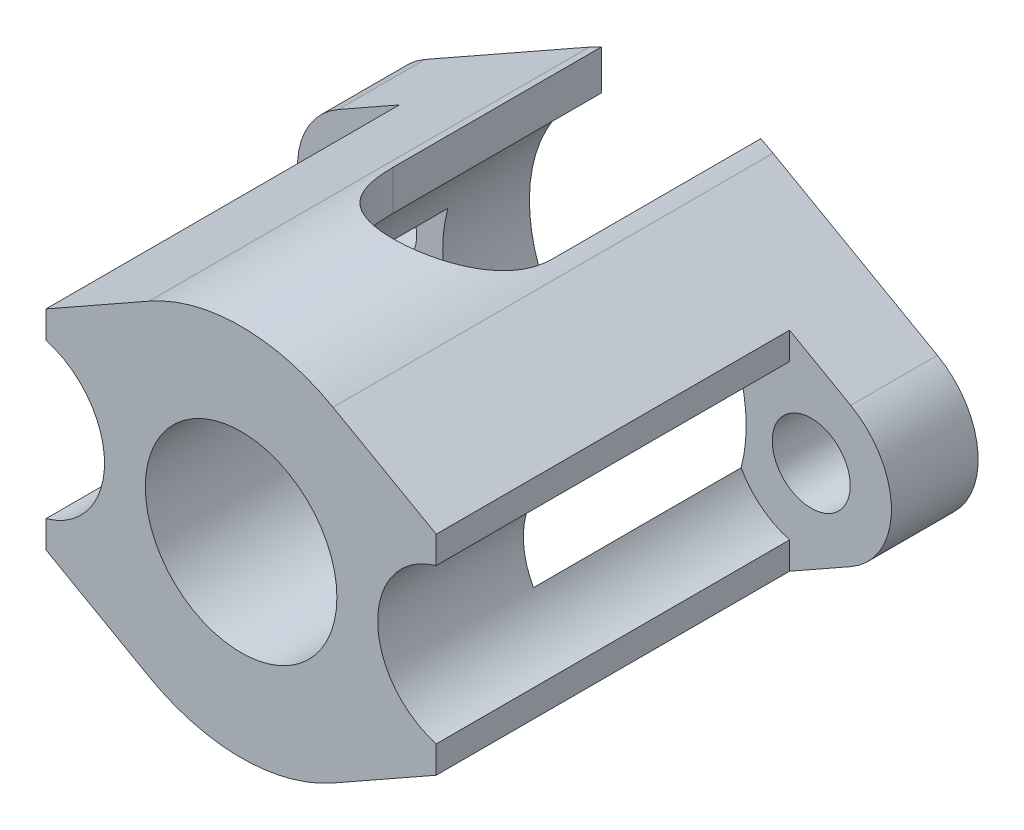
from build123d import *

# Parameters (mm, degrees)
SKETCH1_R               = 2.286
SKETCH1_R_2             = 5.6134
BOSS_EXTRUDE1_DEPTH     = 25.781
SKETCH2_R               = 8.89
CUT_EXTRUDE1_DEPTH      = 17.2466
CUT_EXTRUDE2_DEPTH      = 33.973181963
CUT_EXTRUDE2_DEPTH_BACK = 33.973181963
CUT_EXTRUDE3_START      = -20.701
CUT_EXTRUDE3_DEPTH      = 20.701


with BuildPart() as part:
    # Sketch1 → Boss-Extrude1 (new body)
    with BuildSketch(Plane.XY):
        with BuildLine():
            Line((5.3861208, 9.530753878), (15.011908, 4.090926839))
            ThreePointArc((15.011908, 4.090926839), (17.399, 0), (15.011908, -4.090926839))
            Line((15.011908, -4.090926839), (5.3861208, -9.530753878))
            ThreePointArc((5.3861208, -9.530753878), (0, -10.9474), (-5.3861208, -9.530753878))
            Line((-5.3861208, -9.530753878), (-15.011908, -4.090926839))
            ThreePointArc((-15.011908, -4.090926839), (-17.399, 0), (-15.011908, 4.090926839))
            Line((-15.011908, 4.090926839), (-5.3861208, 9.530753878))
            ThreePointArc((-5.3861208, 9.530753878), (0, 10.9474), (5.3861208, 9.530753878))
        make_face()
        with Locations((12.7, 0)):
            Circle(SKETCH1_R, mode=Mode.SUBTRACT)
        Circle(SKETCH1_R_2, mode=Mode.SUBTRACT)
        with Locations(Location((-12.7, 0, 0), (0, 0, 180))):
            Circle(SKETCH1_R, mode=Mode.SUBTRACT)
    extrude(amount=BOSS_EXTRUDE1_DEPTH)

    # Sketch2 → Cut-Extrude1 (cut)
    with BuildSketch(Plane(origin=(0, 0, 0), x_dir=(-1, 0, 0), z_dir=(0, 0, -1))):
        Circle(SKETCH2_R)
    extrude(amount=-CUT_EXTRUDE1_DEPTH, mode=Mode.SUBTRACT)

    # Sketch3 → Cut-Extrude2 (cut, two sides: drawn at the far end of the back side and taken through both)
    with BuildSketch(Plane(origin=(0, 0, 0), x_dir=(1, 0, 0), z_dir=(0, 1, 0)).offset(-CUT_EXTRUDE2_DEPTH_BACK)):
        with BuildLine():
            Line((0, 0), (4.6609, 0))
            Line((4.6609, 0), (4.6609, -12.2301))
            ThreePointArc((4.6609, -12.2301), (0, -16.891), (-4.6609, -12.2301))
            Line((-4.6609, -12.2301), (-4.6609, 0))
            Line((-4.6609, 0), (0, 0))
        make_face()
    extrude(amount=CUT_EXTRUDE2_DEPTH + CUT_EXTRUDE2_DEPTH_BACK, mode=Mode.SUBTRACT)

    # Sketch4 → Cut-Extrude3 (cut)
    with BuildSketch(Plane.XY.offset(25.781).offset(CUT_EXTRUDE3_START)):
        with BuildLine():
            Line((-11.43, -9.359555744), (-11.43, -4.524124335))
            ThreePointArc((-11.43, -4.524124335), (-8.001, 0), (-11.43, 4.524124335))
            Line((-11.43, 4.524124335), (-11.43, 9.359555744))
            ThreePointArc((-11.43, 9.359555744), (-22.145326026, 0), (-11.43, -9.359555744))
        make_face()
        with BuildLine():
            Line((11.43, -9.359555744), (11.43, -4.524124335))
            ThreePointArc((11.43, -4.524124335), (8.001, 0), (11.43, 4.524124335))
            Line((11.43, 4.524124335), (11.43, 9.359555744))
            ThreePointArc((11.43, 9.359555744), (22.145326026, 0), (11.43, -9.359555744))
        make_face()
    extrude(amount=CUT_EXTRUDE3_DEPTH, mode=Mode.SUBTRACT)


solid = part.part
